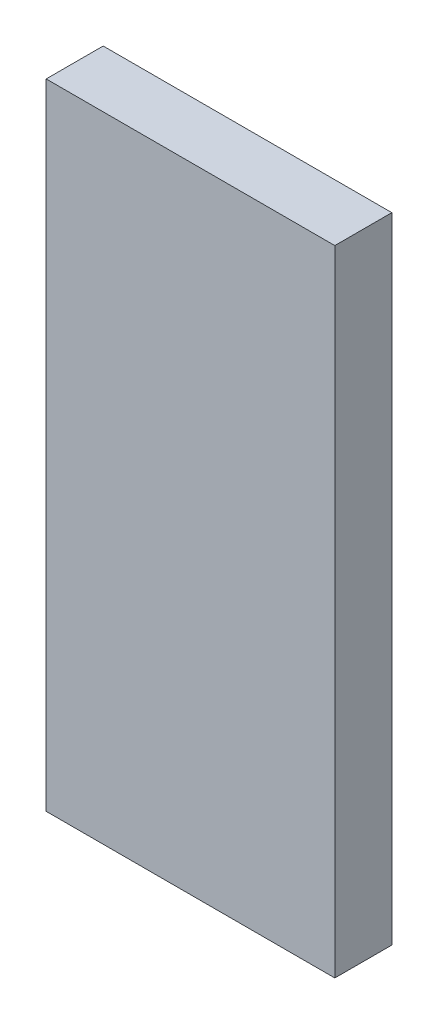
from build123d import *

# Parameters (mm, degrees)
ESQUISSE1_W      = 40.5
ESQUISSE1_H      = 89
EXTRUSION1_DEPTH = 8


with BuildPart() as part:
    # Esquisse1 → Extrusion1 (new body)
    with BuildSketch(Plane.XY):
        with Locations((20.25, 44.5)):
            Rectangle(ESQUISSE1_W, ESQUISSE1_H)
    extrude(amount=EXTRUSION1_DEPTH)


solid = part.part
